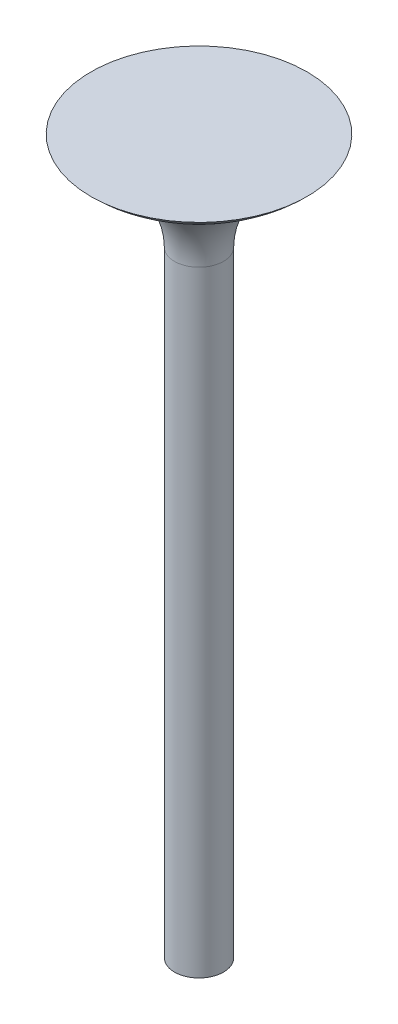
ISO-10303-21;
HEADER;
FILE_DESCRIPTION(('STEP AP214'),'2;1');
FILE_NAME('part.step','',(''),(''),'','','');
FILE_SCHEMA(('AUTOMOTIVE_DESIGN { 1 0 10303 214 1 1 1 1 }'));
ENDSEC;
DATA;
#1=APPLICATION_CONTEXT('core data for automotive mechanical design processes');
#2=APPLICATION_PROTOCOL_DEFINITION('international standard','automotive_design',2000,#1);
#3=PRODUCT_CONTEXT('',#1,'mechanical');
#4=PRODUCT('Part','Part','',(#3));
#5=PRODUCT_RELATED_PRODUCT_CATEGORY('part','',(#4));
#6=PRODUCT_DEFINITION_FORMATION('','',#4);
#7=PRODUCT_DEFINITION_CONTEXT('part definition',#1,'design');
#8=PRODUCT_DEFINITION('design','',#6,#7);
#9=PRODUCT_DEFINITION_SHAPE('','',#8);
#10=(LENGTH_UNIT() NAMED_UNIT(*) SI_UNIT(.MILLI.,.METRE.));
#11=(NAMED_UNIT(*) PLANE_ANGLE_UNIT() SI_UNIT($,.RADIAN.));
#12=(NAMED_UNIT(*) SI_UNIT($,.STERADIAN.) SOLID_ANGLE_UNIT());
#13=UNCERTAINTY_MEASURE_WITH_UNIT(LENGTH_MEASURE(1.E-05),#10,'distance_accuracy_value','');
#14=(GEOMETRIC_REPRESENTATION_CONTEXT(3) GLOBAL_UNCERTAINTY_ASSIGNED_CONTEXT((#13)) GLOBAL_UNIT_ASSIGNED_CONTEXT((#10,
#11,#12)) REPRESENTATION_CONTEXT('',''));
#15=CARTESIAN_POINT('',(0.,0.,0.));
#16=DIRECTION('',(0.,0.,1.));
#17=DIRECTION('',(1.,0.,0.));
#18=AXIS2_PLACEMENT_3D('',#15,#16,#17);
#19=CARTESIAN_POINT('',(0.,100.,0.));
#20=DIRECTION('',(0.,-1.,0.));
#21=DIRECTION('',(0.,0.,-1.));
#22=AXIS2_PLACEMENT_3D('',#19,#20,#21);
#23=CYLINDRICAL_SURFACE('',#22,3.5);
#24=CARTESIAN_POINT('',(0.,88.0001041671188,0.));
#25=DIRECTION('',(0.,1.,0.));
#26=DIRECTION('',(0.,0.,1.));
#27=AXIS2_PLACEMENT_3D('',#24,#25,#26);
#28=CIRCLE('',#27,3.5);
#29=CARTESIAN_POINT('',(0.,88.0001041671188,3.5));
#30=VERTEX_POINT('',#29);
#31=EDGE_CURVE('E37',#30,#30,#28,.F.);
#32=ORIENTED_EDGE('',*,*,#31,.T.);
#33=EDGE_LOOP('',(#32));
#34=FACE_BOUND('',#33,.T.);
#35=CARTESIAN_POINT('',(0.,0.,0.));
#36=DIRECTION('',(0.,1.,0.));
#37=DIRECTION('',(0.,0.,1.));
#38=AXIS2_PLACEMENT_3D('',#35,#36,#37);
#39=CIRCLE('',#38,3.5);
#40=CARTESIAN_POINT('',(0.,0.,3.5));
#41=VERTEX_POINT('',#40);
#42=EDGE_CURVE('E41',#41,#41,#39,.T.);
#43=ORIENTED_EDGE('',*,*,#42,.T.);
#44=EDGE_LOOP('',(#43));
#45=FACE_BOUND('',#44,.T.);
#46=ADVANCED_FACE('F30',(#34,#45),#23,.T.);
#47=CARTESIAN_POINT('',(0.,0.,0.));
#48=DIRECTION('',(0.,1.,0.));
#49=DIRECTION('',(0.,0.,1.));
#50=AXIS2_PLACEMENT_3D('',#47,#48,#49);
#51=PLANE('',#50);
#52=ORIENTED_EDGE('',*,*,#42,.F.);
#53=EDGE_LOOP('',(#52));
#54=FACE_BOUND('',#53,.T.);
#55=ADVANCED_FACE('F60',(#54),#51,.F.);
#56=CARTESIAN_POINT('',(0.,102.,0.));
#57=DIRECTION('',(0.,1.,0.));
#58=DIRECTION('',(0.,0.,1.));
#59=AXIS2_PLACEMENT_3D('',#56,#57,#58);
#60=PLANE('',#59);
#61=CARTESIAN_POINT('',(0.,102.,0.));
#62=DIRECTION('',(0.,1.,0.));
#63=DIRECTION('',(0.,0.,1.));
#64=AXIS2_PLACEMENT_3D('',#61,#62,#63);
#65=CIRCLE('',#64,15.45);
#66=CARTESIAN_POINT('',(0.,102.,15.45));
#67=VERTEX_POINT('',#66);
#68=EDGE_CURVE('E45',#67,#67,#65,.T.);
#69=ORIENTED_EDGE('',*,*,#68,.T.);
#70=EDGE_LOOP('',(#69));
#71=FACE_BOUND('',#70,.T.);
#72=ADVANCED_FACE('F51',(#71),#60,.T.);
#73=CARTESIAN_POINT('',(0.,88.0001041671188,0.));
#74=DIRECTION('',(0.,1.,0.));
#75=DIRECTION('',(0.,0.,1.));
#76=AXIS2_PLACEMENT_3D('',#73,#74,#75);
#77=TOROIDAL_SURFACE('',#76,15.5,12.);
#78=CARTESIAN_POINT('',(0.,99.199069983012,0.));
#79=DIRECTION('',(0.,-1.,0.));
#80=DIRECTION('',(0.,0.,-1.));
#81=AXIS2_PLACEMENT_3D('',#78,#79,#80);
#82=CIRCLE('',#81,11.1891805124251);
#83=CARTESIAN_POINT('',(0.,99.199069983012,-11.1891805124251));
#84=VERTEX_POINT('',#83);
#85=EDGE_CURVE('E10',#84,#84,#82,.T.);
#86=ORIENTED_EDGE('',*,*,#85,.T.);
#87=EDGE_LOOP('',(#86));
#88=FACE_BOUND('',#87,.T.);
#89=ORIENTED_EDGE('',*,*,#31,.F.);
#90=EDGE_LOOP('',(#89));
#91=FACE_BOUND('',#90,.T.);
#92=ADVANCED_FACE('F54',(#88,#91),#77,.F.);
#93=CARTESIAN_POINT('',(0.,110.398035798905,0.));
#94=DIRECTION('',(0.,1.,0.));
#95=DIRECTION('',(0.,0.,1.));
#96=AXIS2_PLACEMENT_3D('',#93,#94,#95);
#97=DEGENERATE_TOROIDAL_SURFACE('',#96,6.87836102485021,12.,.T.);
#98=ORIENTED_EDGE('',*,*,#85,.F.);
#99=EDGE_LOOP('',(#98));
#100=FACE_BOUND('',#99,.T.);
#101=ORIENTED_EDGE('',*,*,#68,.F.);
#102=EDGE_LOOP('',(#101));
#103=FACE_BOUND('',#102,.T.);
#104=ADVANCED_FACE('F32',(#100,#103),#97,.T.);
#105=CLOSED_SHELL('',(#46,#55,#72,#92,#104));
#106=MANIFOLD_SOLID_BREP('B2',#105);
#107=ADVANCED_BREP_SHAPE_REPRESENTATION('',(#18,#106),#14);
#108=SHAPE_DEFINITION_REPRESENTATION(#9,#107);
ENDSEC;
END-ISO-10303-21;
